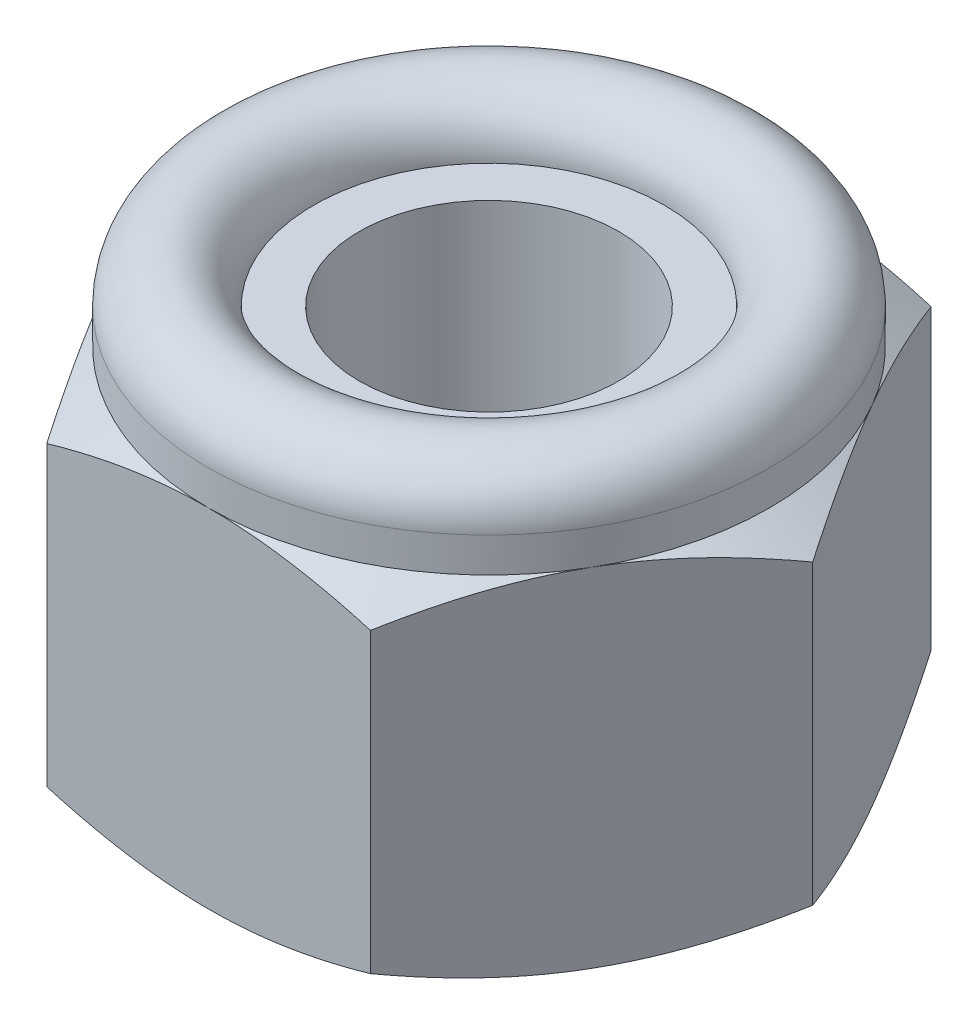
from build123d import *

# Parameters (mm, degrees)
ESQUISSE2_OUTSIDE_W     = 31.492
ESQUISSE2_OUTSIDE_H     = 31.492
ENL_V_MAT_EXTRU_2_DEPTH = 21.242529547
CHANFREIN2_SIZE         = 1.5


with BuildPart() as part:
    # Esquisse1 → Base-R_volution (revolve)
    with BuildSketch(Plane.XY, mode=Mode.PRIVATE) as base_r_volution_sk:
        with BuildLine():
            Line((5, 10.900000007), (6.499999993, 10.900000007))
            Line((6.499999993, 10.900000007), (6.499999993, 8.749999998))
            Line((6.499999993, 8.749999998), (3.700961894, 8))
            Line((3.700961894, 8), (3.700961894, 0))
            Line((3.700961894, 0), (8, 0))
            Line((8, 0), (11.313708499, 1.913170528))
            Line((11.313708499, 1.913170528), (11.313708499, 8))
            Line((11.313708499, 8), (7.999999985, 9.913170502))
            Line((7.999999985, 9.913170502), (7.999999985, 10.900000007))
            ThreePointArc((7.999999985, 10.900000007), (6.499999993, 12.4), (5, 10.900000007))
        make_face()
    revolve(base_r_volution_sk.sketch.rotate(Axis((0, 0, 0), (0, 1, 0)), 90), axis=Axis((0, 0, 0), (0, 1, 0)))

    # Esquisse2 outside → Enl_v. mat.-Extru.2 (cut, through all)
    with BuildSketch(Plane(origin=(0, 0, 0), x_dir=(1, 0, 0), z_dir=(0, 1, 0))):
        Rectangle(ESQUISSE2_OUTSIDE_W, ESQUISSE2_OUTSIDE_H)
        Polygon((-4.618802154, 8), (4.618802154, 8), (9.237604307, 0), (4.618802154, -8), (-4.618802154, -8), (-9.237604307, 0), align=None, mode=Mode.SUBTRACT)
    extrude(amount=ENL_V_MAT_EXTRU_2_DEPTH, mode=Mode.SUBTRACT)

    # Chanfrein2
    chanfrein2_edges = [part.edges().sort_by_distance(p)[0] for p in [
        (0, 0, 3.700961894),
    ]]
    chamfer(chanfrein2_edges, length=CHANFREIN2_SIZE)

    # Esquisse4 → Boss.-R_vol.1 (revolve)
    with BuildSketch(Plane.XY, mode=Mode.PRIVATE) as boss_r_vol_1_sk:
        Polygon((6.499999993, 10.900000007), (3.700961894, 10.900000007), (3.700961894, 8), (6.499999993, 8.749999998), align=None)
    revolve(boss_r_vol_1_sk.sketch.rotate(Axis((0, 9.913170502, 0), (0, -1, 0)), 270), axis=Axis((0, 9.913170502, 0), (0, -1, 0)))


solid = part.part
